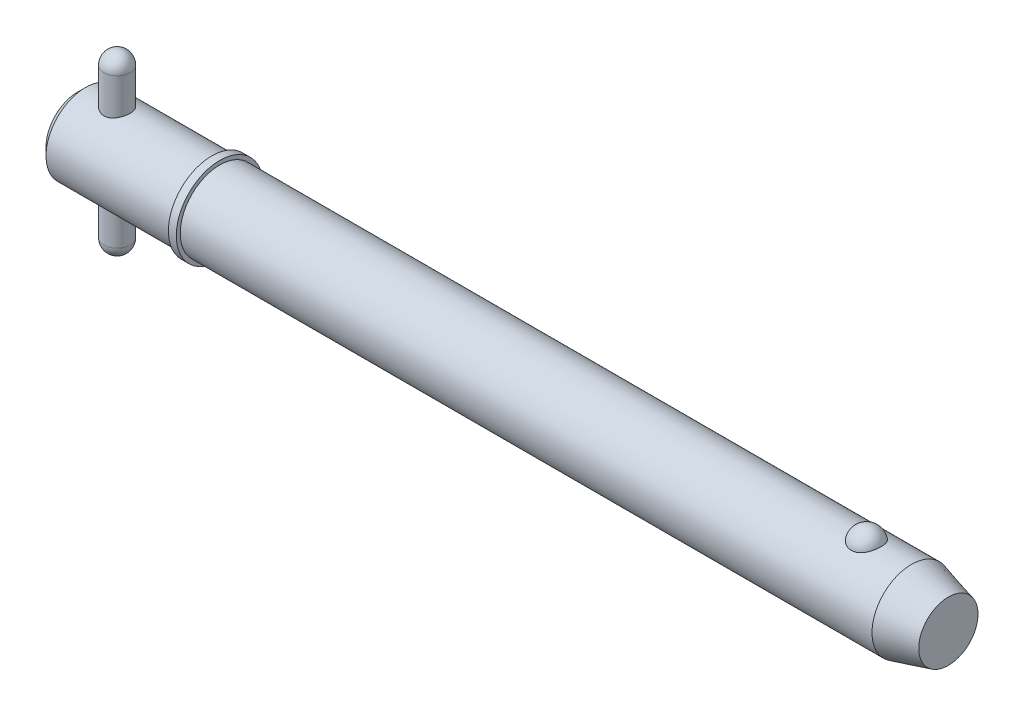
ISO-10303-21;
HEADER;
FILE_DESCRIPTION(('STEP AP214'),'2;1');
FILE_NAME('part.step','',(''),(''),'','','');
FILE_SCHEMA(('AUTOMOTIVE_DESIGN { 1 0 10303 214 1 1 1 1 }'));
ENDSEC;
DATA;
#1=APPLICATION_CONTEXT('core data for automotive mechanical design processes');
#2=APPLICATION_PROTOCOL_DEFINITION('international standard','automotive_design',2000,#1);
#3=PRODUCT_CONTEXT('',#1,'mechanical');
#4=PRODUCT('Part','Part','',(#3));
#5=PRODUCT_RELATED_PRODUCT_CATEGORY('part','',(#4));
#6=PRODUCT_DEFINITION_FORMATION('','',#4);
#7=PRODUCT_DEFINITION_CONTEXT('part definition',#1,'design');
#8=PRODUCT_DEFINITION('design','',#6,#7);
#9=PRODUCT_DEFINITION_SHAPE('','',#8);
#10=(LENGTH_UNIT() NAMED_UNIT(*) SI_UNIT(.MILLI.,.METRE.));
#11=(NAMED_UNIT(*) PLANE_ANGLE_UNIT() SI_UNIT($,.RADIAN.));
#12=(NAMED_UNIT(*) SI_UNIT($,.STERADIAN.) SOLID_ANGLE_UNIT());
#13=UNCERTAINTY_MEASURE_WITH_UNIT(LENGTH_MEASURE(1.E-05),#10,'distance_accuracy_value','');
#14=(GEOMETRIC_REPRESENTATION_CONTEXT(3) GLOBAL_UNCERTAINTY_ASSIGNED_CONTEXT((#13)) GLOBAL_UNIT_ASSIGNED_CONTEXT((#10,
#11,#12)) REPRESENTATION_CONTEXT('',''));
#15=CARTESIAN_POINT('',(0.,0.,0.));
#16=DIRECTION('',(0.,0.,1.));
#17=DIRECTION('',(1.,0.,0.));
#18=AXIS2_PLACEMENT_3D('',#15,#16,#17);
#19=CARTESIAN_POINT('',(7.14,15.875,0.));
#20=DIRECTION('',(0.,-1.,0.));
#21=DIRECTION('',(0.,0.,-1.));
#22=AXIS2_PLACEMENT_3D('',#19,#20,#21);
#23=CYLINDRICAL_SURFACE('',#22,2.38);
#24=CARTESIAN_POINT('',(7.14,-13.495,0.));
#25=DIRECTION('',(0.,-1.,0.));
#26=DIRECTION('',(0.,0.,-1.));
#27=AXIS2_PLACEMENT_3D('',#24,#25,#26);
#28=CIRCLE('',#27,2.38);
#29=CARTESIAN_POINT('',(7.14,-13.495,-2.38));
#30=VERTEX_POINT('',#29);
#31=EDGE_CURVE('P0_E10',#30,#30,#28,.F.);
#32=ORIENTED_EDGE('',*,*,#31,.T.);
#33=EDGE_LOOP('',(#32));
#34=FACE_BOUND('',#33,.T.);
#35=CARTESIAN_POINT('',(7.14,13.495,0.));
#36=DIRECTION('',(0.,-1.,0.));
#37=DIRECTION('',(0.,0.,-1.));
#38=AXIS2_PLACEMENT_3D('',#35,#36,#37);
#39=CIRCLE('',#38,2.38);
#40=CARTESIAN_POINT('',(7.14,13.495,-2.38));
#41=VERTEX_POINT('',#40);
#42=EDGE_CURVE('P0_E21',#41,#41,#39,.T.);
#43=ORIENTED_EDGE('',*,*,#42,.T.);
#44=EDGE_LOOP('',(#43));
#45=FACE_BOUND('',#44,.T.);
#46=ADVANCED_FACE('P0_F14',(#34,#45),#23,.T.);
#47=CARTESIAN_POINT('',(7.14,-13.495,0.));
#48=DIRECTION('',(0.,0.,1.));
#49=DIRECTION('',(1.,0.,0.));
#50=AXIS2_PLACEMENT_3D('',#47,#48,#49);
#51=SPHERICAL_SURFACE('',#50,2.38);
#52=CARTESIAN_POINT('',(7.14,-13.495,0.));
#53=DIRECTION('',(0.,-1.,0.));
#54=DIRECTION('',(0.,0.,-1.));
#55=AXIS2_PLACEMENT_3D('',#52,#53,#54);
#56=SPHERICAL_SURFACE('',#55,2.38);
#57=ORIENTED_EDGE('',*,*,#31,.F.);
#58=EDGE_LOOP('',(#57));
#59=FACE_BOUND('',#58,.T.);
#60=ADVANCED_FACE('P0_F29',(#59),#56,.T.);
#61=CARTESIAN_POINT('',(7.14,13.495,0.));
#62=DIRECTION('',(0.,0.,1.));
#63=DIRECTION('',(1.,0.,0.));
#64=AXIS2_PLACEMENT_3D('',#61,#62,#63);
#65=SPHERICAL_SURFACE('',#64,2.38);
#66=CARTESIAN_POINT('',(7.14,13.495,0.));
#67=DIRECTION('',(0.,-1.,0.));
#68=DIRECTION('',(0.,0.,-1.));
#69=AXIS2_PLACEMENT_3D('',#66,#67,#68);
#70=SPHERICAL_SURFACE('',#69,2.38);
#71=ORIENTED_EDGE('',*,*,#42,.F.);
#72=EDGE_LOOP('',(#71));
#73=FACE_BOUND('',#72,.T.);
#74=ADVANCED_FACE('P0_F16',(#73),#70,.T.);
#75=CLOSED_SHELL('',(#46,#60,#74));
#76=MANIFOLD_SOLID_BREP('P0_B1',#75);
#77=CARTESIAN_POINT('',(0.,0.,0.));
#78=DIRECTION('',(1.,0.,0.));
#79=DIRECTION('',(0.,0.,-1.));
#80=AXIS2_PLACEMENT_3D('',#77,#78,#79);
#81=CYLINDRICAL_SURFACE('',#80,7.145);
#82=CARTESIAN_POINT('',(150.78362424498,0.,0.));
#83=DIRECTION('',(1.,0.,0.));
#84=DIRECTION('',(0.,0.,-1.));
#85=AXIS2_PLACEMENT_3D('',#82,#83,#84);
#86=CIRCLE('',#85,7.145);
#87=CARTESIAN_POINT('',(150.78362424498,0.,-7.145));
#88=VERTEX_POINT('',#87);
#89=EDGE_CURVE('P1_E81',#88,#88,#86,.T.);
#90=ORIENTED_EDGE('',*,*,#89,.F.);
#91=EDGE_LOOP('',(#90));
#92=FACE_BOUND('',#91,.T.);
#93=CARTESIAN_POINT('',(25.7,0.,0.));
#94=DIRECTION('',(1.,0.,0.));
#95=DIRECTION('',(0.,0.,-1.));
#96=AXIS2_PLACEMENT_3D('',#93,#94,#95);
#97=CIRCLE('',#96,7.145);
#98=CARTESIAN_POINT('',(25.7,0.,-7.145));
#99=VERTEX_POINT('',#98);
#100=EDGE_CURVE('P1_E85',#99,#99,#97,.T.);
#101=ORIENTED_EDGE('',*,*,#100,.T.);
#102=EDGE_LOOP('',(#101));
#103=FACE_BOUND('',#102,.T.);
#104=CARTESIAN_POINT('',(142.639503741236,6.60328629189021,2.72903557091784));
#105=CARTESIAN_POINT('',(142.498315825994,6.60329644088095,2.7290249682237));
#106=CARTESIAN_POINT('',(142.356883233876,6.60799490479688,2.71772840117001));
#107=CARTESIAN_POINT('',(142.077955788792,6.62628236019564,2.6728193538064));
#108=CARTESIAN_POINT('',(141.940472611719,6.63989534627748,2.63914664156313));
#109=CARTESIAN_POINT('',(141.673889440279,6.67440775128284,2.55059642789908));
#110=CARTESIAN_POINT('',(141.544768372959,6.69528793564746,2.49577486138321));
#111=CARTESIAN_POINT('',(141.297869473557,6.74205585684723,2.36651799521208));
#112=CARTESIAN_POINT('',(141.180086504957,6.76794130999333,2.2920916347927));
#113=CARTESIAN_POINT('',(140.95516710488,6.82286177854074,2.12312937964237));
#114=CARTESIAN_POINT('',(140.848440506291,6.85196655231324,2.0280710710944));
#115=CARTESIAN_POINT('',(140.651918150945,6.90970232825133,1.82167822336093));
#116=CARTESIAN_POINT('',(140.562127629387,6.93833318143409,1.71033867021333));
#117=CARTESIAN_POINT('',(140.397667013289,6.9935167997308,1.46891951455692));
#118=CARTESIAN_POINT('',(140.323844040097,7.01992110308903,1.33822781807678));
#119=CARTESIAN_POINT('',(140.198088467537,7.06643385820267,1.06566567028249));
#120=CARTESIAN_POINT('',(140.14615735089,7.08654188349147,0.923794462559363));
#121=CARTESIAN_POINT('',(140.064732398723,7.11862399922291,0.630993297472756));
#122=CARTESIAN_POINT('',(140.035516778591,7.13049704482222,0.479974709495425));
#123=CARTESIAN_POINT('',(140.001174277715,7.14449484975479,0.174782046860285));
#124=CARTESIAN_POINT('',(139.996046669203,7.14661990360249,0.020608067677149));
#125=CARTESIAN_POINT('',(140.009938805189,7.14092465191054,-0.285506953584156));
#126=CARTESIAN_POINT('',(140.028810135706,7.1331654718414,-0.437455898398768));
#127=CARTESIAN_POINT('',(140.090062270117,7.10859076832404,-0.73577860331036));
#128=CARTESIAN_POINT('',(140.132443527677,7.0917750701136,-0.882152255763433));
#129=CARTESIAN_POINT('',(140.239934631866,7.05076716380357,-1.16543149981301));
#130=CARTESIAN_POINT('',(140.305075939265,7.02656475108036,-1.30232366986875));
#131=CARTESIAN_POINT('',(140.456759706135,6.97329145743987,-1.56265907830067));
#132=CARTESIAN_POINT('',(140.543303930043,6.94422017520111,-1.68610120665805));
#133=CARTESIAN_POINT('',(140.736465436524,6.88415108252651,-1.91671004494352));
#134=CARTESIAN_POINT('',(140.843180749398,6.85314438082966,-2.02379244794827));
#135=CARTESIAN_POINT('',(141.073974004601,6.79282069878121,-2.21787433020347));
#136=CARTESIAN_POINT('',(141.198050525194,6.76350358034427,-2.30487545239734));
#137=CARTESIAN_POINT('',(141.457678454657,6.71060580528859,-2.45458647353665));
#138=CARTESIAN_POINT('',(141.592938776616,6.68691885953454,-2.51776240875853));
#139=CARTESIAN_POINT('',(141.873277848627,6.64741247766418,-2.62030218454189));
#140=CARTESIAN_POINT('',(142.018352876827,6.63159007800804,-2.65967499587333));
#141=CARTESIAN_POINT('',(142.306347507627,6.61038594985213,-2.71193301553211));
#142=CARTESIAN_POINT('',(142.44900807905,6.60451880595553,-2.72605165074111));
#143=CARTESIAN_POINT('',(142.73480047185,6.60240611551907,-2.73116688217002));
#144=CARTESIAN_POINT('',(142.877932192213,6.60615862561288,-2.7221681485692));
#145=CARTESIAN_POINT('',(143.155848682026,6.62256094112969,-2.68200435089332));
#146=CARTESIAN_POINT('',(143.290754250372,6.63492533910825,-2.65154998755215));
#147=CARTESIAN_POINT('',(143.55332009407,6.66687445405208,-2.57015684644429));
#148=CARTESIAN_POINT('',(143.68097978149,6.68645975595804,-2.51921640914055));
#149=CARTESIAN_POINT('',(143.928577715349,6.73127274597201,-2.39693610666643));
#150=CARTESIAN_POINT('',(144.048287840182,6.7566138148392,-2.32517694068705));
#151=CARTESIAN_POINT('',(144.274159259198,6.81006003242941,-2.16363812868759));
#152=CARTESIAN_POINT('',(144.380317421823,6.83816581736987,-2.07385432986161));
#153=CARTESIAN_POINT('',(144.581862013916,6.89580469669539,-1.87357235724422));
#154=CARTESIAN_POINT('',(144.676440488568,6.92533863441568,-1.76226074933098));
#155=CARTESIAN_POINT('',(144.846332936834,6.98139526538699,-1.5251169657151));
#156=CARTESIAN_POINT('',(144.921643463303,7.0079174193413,-1.39928219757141));
#157=CARTESIAN_POINT('',(145.053595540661,7.05607625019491,-1.1321597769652));
#158=CARTESIAN_POINT('',(145.109568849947,7.07753119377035,-0.990508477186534));
#159=CARTESIAN_POINT('',(145.198296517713,7.11222355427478,-0.699154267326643));
#160=CARTESIAN_POINT('',(145.231050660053,7.12546089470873,-0.549451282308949));
#161=CARTESIAN_POINT('',(145.272689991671,7.14237584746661,-0.246120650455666));
#162=CARTESIAN_POINT('',(145.281558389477,7.14604673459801,-0.0924903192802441));
#163=CARTESIAN_POINT('',(145.275194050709,7.14343510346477,0.214181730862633));
#164=CARTESIAN_POINT('',(145.259961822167,7.13715279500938,0.367223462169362));
#165=CARTESIAN_POINT('',(145.205845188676,7.1153294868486,0.667595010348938));
#166=CARTESIAN_POINT('',(145.167077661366,7.09983424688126,0.814949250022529));
#167=CARTESIAN_POINT('',(145.066770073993,7.06119140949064,1.1006322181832));
#168=CARTESIAN_POINT('',(145.005228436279,7.03804328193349,1.23896032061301));
#169=CARTESIAN_POINT('',(144.860207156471,6.98632429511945,1.50352300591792));
#170=CARTESIAN_POINT('',(144.776606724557,6.95772382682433,1.62968561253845));
#171=CARTESIAN_POINT('',(144.58938046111,6.89823072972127,1.86554304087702));
#172=CARTESIAN_POINT('',(144.485755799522,6.86733823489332,1.97523882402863));
#173=CARTESIAN_POINT('',(144.261076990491,6.80676456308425,2.174822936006));
#174=CARTESIAN_POINT('',(144.140067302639,6.7770805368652,2.26476035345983));
#175=CARTESIAN_POINT('',(143.883340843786,6.7223050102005,2.42252989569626));
#176=CARTESIAN_POINT('',(143.74761851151,6.69721525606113,2.4903536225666));
#177=CARTESIAN_POINT('',(143.470402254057,6.65552591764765,2.59967646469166));
#178=CARTESIAN_POINT('',(143.329281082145,6.63865794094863,2.6420201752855));
#179=CARTESIAN_POINT('',(143.041444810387,6.61425039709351,2.70255841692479));
#180=CARTESIAN_POINT('',(142.894748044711,6.606682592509,2.72082606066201));
#181=CARTESIAN_POINT('',(142.711679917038,6.60358754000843,2.72830331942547));
#182=CARTESIAN_POINT('',(142.675599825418,6.60328369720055,2.72903828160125));
#183=CARTESIAN_POINT('',(142.639503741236,6.60328629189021,2.72903557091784));
#184=B_SPLINE_CURVE_WITH_KNOTS('',3,(#104,#105,#106,#107,#108,#109,#110,#111,#112,#113,#114,
#115,#116,#117,#118,#119,#120,#121,#122,#123,#124,#125,#126,#127,#128,#129,#130,#131,#132,#133,
#134,#135,#136,#137,#138,#139,#140,#141,#142,#143,#144,#145,#146,#147,#148,#149,#150,#151,#152,
#153,#154,#155,#156,#157,#158,#159,#160,#161,#162,#163,#164,#165,#166,#167,#168,#169,#170,#171,
#172,#173,#174,#175,#176,#177,#178,#179,#180,#181,#182,#183),.UNSPECIFIED.,.T.,.F.,(4,2,2,2,2,2,
2,2,2,2,2,2,2,2,2,2,2,2,2,2,2,2,2,2,2,2,2,2,2,2,2,2,2,2,2,2,2,2,2,4),(0.,0.423468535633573,
0.848081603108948,1.27157926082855,1.69488414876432,2.13051395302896,2.56627819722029,
3.02136706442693,3.47648674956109,3.93709649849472,4.39769233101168,4.85545355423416,
5.31322361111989,5.77162895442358,6.23007210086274,6.69080337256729,7.15149693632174,
7.60264329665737,8.05361952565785,8.48189729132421,8.91008854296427,9.32472524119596,
9.73939553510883,10.1630783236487,10.5868588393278,11.0319070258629,11.4770347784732,
11.9362874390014,12.3955443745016,12.8551240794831,13.3146940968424,13.7720003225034,
14.2293382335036,14.6892343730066,15.1491036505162,15.6078171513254,16.0667046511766,
16.5093965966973,16.9507410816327,17.0590049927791),.UNSPECIFIED.);
#185=CARTESIAN_POINT('',(142.639503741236,6.60328629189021,2.72903557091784));
#186=VERTEX_POINT('',#185);
#187=EDGE_CURVE('P1_E35',#186,#186,#184,.T.);
#188=ORIENTED_EDGE('',*,*,#187,.T.);
#189=EDGE_LOOP('',(#188));
#190=FACE_BOUND('',#189,.T.);
#191=ADVANCED_FACE('P1_F13',(#92,#103,#190),#81,.T.);
#192=CARTESIAN_POINT('',(0.,0.,0.));
#193=DIRECTION('',(-1.,0.,0.));
#194=DIRECTION('',(0.,0.,1.));
#195=AXIS2_PLACEMENT_3D('',#192,#193,#194);
#196=PLANE('',#195);
#197=CARTESIAN_POINT('',(0.,0.,0.));
#198=DIRECTION('',(1.,0.,0.));
#199=DIRECTION('',(0.,0.,-1.));
#200=AXIS2_PLACEMENT_3D('',#197,#198,#199);
#201=CIRCLE('',#200,5.716);
#202=CARTESIAN_POINT('',(0.,0.,-5.716));
#203=VERTEX_POINT('',#202);
#204=EDGE_CURVE('P1_E9',#203,#203,#201,.T.);
#205=ORIENTED_EDGE('',*,*,#204,.F.);
#206=EDGE_LOOP('',(#205));
#207=FACE_BOUND('',#206,.T.);
#208=ADVANCED_FACE('P1_F15',(#207),#196,.T.);
#209=CARTESIAN_POINT('',(1.42899999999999,0.,0.));
#210=DIRECTION('',(1.,0.,0.));
#211=DIRECTION('',(0.,0.,-1.));
#212=AXIS2_PLACEMENT_3D('',#209,#210,#211);
#213=CONICAL_SURFACE('',#212,7.145,0.78539816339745);
#214=ORIENTED_EDGE('',*,*,#204,.T.);
#215=EDGE_LOOP('',(#214));
#216=FACE_BOUND('',#215,.T.);
#217=CARTESIAN_POINT('',(1.42899999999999,0.,0.));
#218=DIRECTION('',(1.,0.,0.));
#219=DIRECTION('',(0.,0.,-1.));
#220=AXIS2_PLACEMENT_3D('',#217,#218,#219);
#221=CIRCLE('',#220,7.145);
#222=CARTESIAN_POINT('',(1.42899999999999,0.,-7.145));
#223=VERTEX_POINT('',#222);
#224=EDGE_CURVE('P1_E26',#223,#223,#221,.T.);
#225=ORIENTED_EDGE('',*,*,#224,.F.);
#226=EDGE_LOOP('',(#225));
#227=FACE_BOUND('',#226,.T.);
#228=ADVANCED_FACE('P1_F77',(#216,#227),#213,.T.);
#229=CARTESIAN_POINT('',(0.,0.,0.));
#230=DIRECTION('',(1.,0.,0.));
#231=DIRECTION('',(0.,0.,-1.));
#232=AXIS2_PLACEMENT_3D('',#229,#230,#231);
#233=CYLINDRICAL_SURFACE('',#232,7.145);
#234=CARTESIAN_POINT('',(7.14,-6.73695962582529,2.38));
#235=CARTESIAN_POINT('',(7.01035997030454,-6.73695921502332,2.38000059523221));
#236=CARTESIAN_POINT('',(6.88072348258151,-6.74074253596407,2.36937183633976));
#237=CARTESIAN_POINT('',(6.62529075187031,-6.75538853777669,2.32728080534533));
#238=CARTESIAN_POINT('',(6.49949514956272,-6.76625239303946,2.29581507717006));
#239=CARTESIAN_POINT('',(6.2554858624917,-6.79369535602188,2.21327763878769));
#240=CARTESIAN_POINT('',(6.13725786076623,-6.81026326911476,2.16224430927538));
#241=CARTESIAN_POINT('',(5.91100349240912,-6.84723128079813,2.04215132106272));
#242=CARTESIAN_POINT('',(5.80297937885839,-6.86763222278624,1.97308769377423));
#243=CARTESIAN_POINT('',(5.59597854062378,-6.91086152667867,1.81600414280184));
#244=CARTESIAN_POINT('',(5.49745861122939,-6.93375032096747,1.72739874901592));
#245=CARTESIAN_POINT('',(5.31636508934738,-6.97886546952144,1.53499636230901));
#246=CARTESIAN_POINT('',(5.23379405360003,-7.00109171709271,1.43119693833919));
#247=CARTESIAN_POINT('',(5.08487013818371,-7.04307708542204,1.20801318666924));
#248=CARTESIAN_POINT('',(5.01899578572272,-7.06275685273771,1.08829330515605));
#249=CARTESIAN_POINT('',(4.90850130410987,-7.09671988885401,0.838703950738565));
#250=CARTESIAN_POINT('',(4.86387545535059,-7.11100460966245,0.70883722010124));
#251=CARTESIAN_POINT('',(4.79869354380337,-7.13213998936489,0.44742990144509));
#252=CARTESIAN_POINT('',(4.77735497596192,-7.13923172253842,0.316104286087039));
#253=CARTESIAN_POINT('',(4.75686536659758,-7.14603777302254,0.0515578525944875));
#254=CARTESIAN_POINT('',(4.75770861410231,-7.14575398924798,-0.0816624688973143));
#255=CARTESIAN_POINT('',(4.78106216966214,-7.13800438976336,-0.340678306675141));
#256=CARTESIAN_POINT('',(4.80272255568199,-7.13082030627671,-0.466560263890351));
#257=CARTESIAN_POINT('',(4.86569013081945,-7.11043095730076,-0.712788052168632));
#258=CARTESIAN_POINT('',(4.90699865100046,-7.09722528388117,-0.833133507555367));
#259=CARTESIAN_POINT('',(5.00858673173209,-7.06591754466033,-1.06673173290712));
#260=CARTESIAN_POINT('',(5.06910834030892,-7.0477534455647,-1.17987058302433));
#261=CARTESIAN_POINT('',(5.20720514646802,-7.00841977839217,-1.39463797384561));
#262=CARTESIAN_POINT('',(5.28478508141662,-6.987249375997,-1.49626330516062));
#263=CARTESIAN_POINT('',(5.4590800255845,-6.94296010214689,-1.69017445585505));
#264=CARTESIAN_POINT('',(5.55652324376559,-6.91979641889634,-1.78179645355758));
#265=CARTESIAN_POINT('',(5.76558873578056,-6.87497076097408,-1.94761348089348));
#266=CARTESIAN_POINT('',(5.87721318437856,-6.85330901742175,-2.02180583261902));
#267=CARTESIAN_POINT('',(6.11357367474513,-6.81369485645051,-2.15157488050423));
#268=CARTESIAN_POINT('',(6.23847358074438,-6.79579956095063,-2.20687188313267));
#269=CARTESIAN_POINT('',(6.49655785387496,-6.76640630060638,-2.29542443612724));
#270=CARTESIAN_POINT('',(6.62973872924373,-6.75490565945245,-2.32868920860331));
#271=CARTESIAN_POINT('',(6.89417536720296,-6.74020933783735,-2.37088225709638));
#272=CARTESIAN_POINT('',(7.02524746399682,-6.73666278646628,-2.38083959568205));
#273=CARTESIAN_POINT('',(7.28721035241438,-6.73729555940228,-2.37904974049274));
#274=CARTESIAN_POINT('',(7.41810117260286,-6.7414734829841,-2.36730648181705));
#275=CARTESIAN_POINT('',(7.67130717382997,-6.75673471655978,-2.32337336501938));
#276=CARTESIAN_POINT('',(7.79376251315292,-6.76757635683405,-2.29189834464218));
#277=CARTESIAN_POINT('',(8.03162917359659,-6.79467771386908,-2.21025275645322));
#278=CARTESIAN_POINT('',(8.14703924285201,-6.8109383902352,-2.16007887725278));
#279=CARTESIAN_POINT('',(8.37159169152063,-6.84768362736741,-2.04065289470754));
#280=CARTESIAN_POINT('',(8.48041962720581,-6.86828569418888,-1.97084668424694));
#281=CARTESIAN_POINT('',(8.68518919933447,-6.91116416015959,-1.8147657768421));
#282=CARTESIAN_POINT('',(8.78112702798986,-6.93344105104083,-1.72848623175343));
#283=CARTESIAN_POINT('',(8.96215574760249,-6.97845348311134,-1.53698616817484));
#284=CARTESIAN_POINT('',(9.04650427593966,-7.00115965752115,-1.43105491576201));
#285=CARTESIAN_POINT('',(9.19627592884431,-7.04341676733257,-1.20598377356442));
#286=CARTESIAN_POINT('',(9.26169972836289,-7.06296781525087,-1.08684435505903));
#287=CARTESIAN_POINT('',(9.37116617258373,-7.0966205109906,-0.83933303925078));
#288=CARTESIAN_POINT('',(9.41534821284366,-7.11075755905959,-0.711027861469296));
#289=CARTESIAN_POINT('',(9.48132660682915,-7.13214194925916,-0.448245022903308));
#290=CARTESIAN_POINT('',(9.50313102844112,-7.13939177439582,-0.313769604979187));
#291=CARTESIAN_POINT('',(9.5230098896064,-7.14599771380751,-0.049254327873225));
#292=CARTESIAN_POINT('',(9.52215013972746,-7.14570837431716,0.0806974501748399));
#293=CARTESIAN_POINT('',(9.49935359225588,-7.13814116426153,0.338518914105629));
#294=CARTESIAN_POINT('',(9.47741850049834,-7.13086385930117,0.466388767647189));
#295=CARTESIAN_POINT('',(9.4138005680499,-7.11026814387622,0.714400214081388));
#296=CARTESIAN_POINT('',(9.37243609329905,-7.09704726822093,0.834632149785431));
#297=CARTESIAN_POINT('',(9.27142829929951,-7.06592602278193,1.06649582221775));
#298=CARTESIAN_POINT('',(9.2117816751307,-7.04802480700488,1.1781259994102));
#299=CARTESIAN_POINT('',(9.07336776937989,-7.00856499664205,1.39411030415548));
#300=CARTESIAN_POINT('',(8.99397590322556,-6.98689577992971,1.49804368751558));
#301=CARTESIAN_POINT('',(8.81938810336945,-6.9426110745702,1.69146078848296));
#302=CARTESIAN_POINT('',(8.72418713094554,-6.91999528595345,1.78093988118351));
#303=CARTESIAN_POINT('',(8.51623540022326,-6.87531507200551,1.94646188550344));
#304=CARTESIAN_POINT('',(8.4029442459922,-6.85330672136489,2.02184316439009));
#305=CARTESIAN_POINT('',(8.16461714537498,-6.81342065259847,2.1524427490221));
#306=CARTESIAN_POINT('',(8.03958429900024,-6.7955418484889,2.20766635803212));
#307=CARTESIAN_POINT('',(7.78712566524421,-6.76686117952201,2.29403636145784));
#308=CARTESIAN_POINT('',(7.66006989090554,-6.75577342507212,2.32616709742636));
#309=CARTESIAN_POINT('',(7.40200728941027,-6.74082409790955,2.36914495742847));
#310=CARTESIAN_POINT('',(7.27100183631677,-6.73696004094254,2.37999939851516));
#311=CARTESIAN_POINT('',(7.14,-6.73695962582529,2.38));
#312=B_SPLINE_CURVE_WITH_KNOTS('',3,(#234,#235,#236,#237,#238,#239,#240,#241,#242,#243,#244,
#245,#246,#247,#248,#249,#250,#251,#252,#253,#254,#255,#256,#257,#258,#259,#260,#261,#262,#263,
#264,#265,#266,#267,#268,#269,#270,#271,#272,#273,#274,#275,#276,#277,#278,#279,#280,#281,#282,
#283,#284,#285,#286,#287,#288,#289,#290,#291,#292,#293,#294,#295,#296,#297,#298,#299,#300,#301,
#302,#303,#304,#305,#306,#307,#308,#309,#310,#311),.UNSPECIFIED.,.T.,.F.,(4,2,2,2,2,2,2,2,2,2,2,
2,2,2,2,2,2,2,2,2,2,2,2,2,2,2,2,2,2,2,2,2,2,2,2,2,2,2,4),(0.,0.388434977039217,
0.776934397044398,1.16467566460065,1.55250234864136,1.9540847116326,2.35573139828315,
2.76784120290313,3.17984001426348,3.57752248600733,3.97510257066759,4.35711073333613,
4.7391447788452,5.12619663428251,5.51335611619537,5.91871976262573,6.3241456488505,
6.73533623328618,7.14635459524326,7.53885245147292,7.93127914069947,8.31025106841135,
8.68929014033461,9.08033871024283,9.47150254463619,9.88145528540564,10.2913934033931,
10.6986033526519,11.1056664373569,11.4936225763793,11.8815473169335,12.2633262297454,
12.645174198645,13.0411187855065,13.437189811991,13.8487371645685,14.2601761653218,
14.6528265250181,15.0453418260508),.UNSPECIFIED.);
#313=CARTESIAN_POINT('',(7.14,-6.73695962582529,2.38));
#314=VERTEX_POINT('',#313);
#315=EDGE_CURVE('P1_E17',#314,#314,#312,.T.);
#316=ORIENTED_EDGE('',*,*,#315,.F.);
#317=EDGE_LOOP('',(#316));
#318=FACE_BOUND('',#317,.T.);
#319=CARTESIAN_POINT('',(7.14,6.73695962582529,2.38));
#320=CARTESIAN_POINT('',(7.26964002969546,6.73695921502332,2.38000059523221));
#321=CARTESIAN_POINT('',(7.39927651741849,6.74074253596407,2.36937183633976));
#322=CARTESIAN_POINT('',(7.65470924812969,6.75538853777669,2.32728080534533));
#323=CARTESIAN_POINT('',(7.78050485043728,6.76625239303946,2.29581507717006));
#324=CARTESIAN_POINT('',(8.02451413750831,6.79369535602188,2.21327763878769));
#325=CARTESIAN_POINT('',(8.14274213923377,6.81026326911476,2.16224430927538));
#326=CARTESIAN_POINT('',(8.36899650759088,6.84723128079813,2.04215132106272));
#327=CARTESIAN_POINT('',(8.47702062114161,6.86763222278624,1.97308769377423));
#328=CARTESIAN_POINT('',(8.68402145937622,6.91086152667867,1.81600414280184));
#329=CARTESIAN_POINT('',(8.78254138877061,6.93375032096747,1.72739874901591));
#330=CARTESIAN_POINT('',(8.96363491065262,6.97886546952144,1.53499636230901));
#331=CARTESIAN_POINT('',(9.04620594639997,7.00109171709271,1.43119693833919));
#332=CARTESIAN_POINT('',(9.19512986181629,7.04307708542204,1.20801318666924));
#333=CARTESIAN_POINT('',(9.26100421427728,7.06275685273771,1.08829330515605));
#334=CARTESIAN_POINT('',(9.37149869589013,7.09671988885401,0.838703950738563));
#335=CARTESIAN_POINT('',(9.41612454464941,7.11100460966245,0.708837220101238));
#336=CARTESIAN_POINT('',(9.48130645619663,7.13213998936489,0.447429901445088));
#337=CARTESIAN_POINT('',(9.50264502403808,7.13923172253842,0.316104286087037));
#338=CARTESIAN_POINT('',(9.52313463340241,7.14603777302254,0.0515578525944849));
#339=CARTESIAN_POINT('',(9.52229138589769,7.14575398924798,-0.0816624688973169));
#340=CARTESIAN_POINT('',(9.49893783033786,7.13800438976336,-0.340678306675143));
#341=CARTESIAN_POINT('',(9.47727744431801,7.13082030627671,-0.466560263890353));
#342=CARTESIAN_POINT('',(9.41430986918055,7.11043095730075,-0.712788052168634));
#343=CARTESIAN_POINT('',(9.37300134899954,7.09722528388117,-0.833133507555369));
#344=CARTESIAN_POINT('',(9.27141326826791,7.06591754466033,-1.06673173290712));
#345=CARTESIAN_POINT('',(9.21089165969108,7.0477534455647,-1.17987058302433));
#346=CARTESIAN_POINT('',(9.07279485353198,7.00841977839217,-1.39463797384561));
#347=CARTESIAN_POINT('',(8.99521491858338,6.987249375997,-1.49626330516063));
#348=CARTESIAN_POINT('',(8.82091997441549,6.94296010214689,-1.69017445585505));
#349=CARTESIAN_POINT('',(8.72347675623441,6.91979641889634,-1.78179645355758));
#350=CARTESIAN_POINT('',(8.51441126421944,6.87497076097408,-1.94761348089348));
#351=CARTESIAN_POINT('',(8.40278681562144,6.85330901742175,-2.02180583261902));
#352=CARTESIAN_POINT('',(8.16642632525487,6.81369485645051,-2.15157488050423));
#353=CARTESIAN_POINT('',(8.04152641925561,6.79579956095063,-2.20687188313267));
#354=CARTESIAN_POINT('',(7.78344214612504,6.76640630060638,-2.29542443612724));
#355=CARTESIAN_POINT('',(7.65026127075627,6.75490565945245,-2.32868920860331));
#356=CARTESIAN_POINT('',(7.38582463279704,6.74020933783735,-2.37088225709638));
#357=CARTESIAN_POINT('',(7.25475253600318,6.73666278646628,-2.38083959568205));
#358=CARTESIAN_POINT('',(6.99278964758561,6.73729555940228,-2.37904974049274));
#359=CARTESIAN_POINT('',(6.86189882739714,6.7414734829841,-2.36730648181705));
#360=CARTESIAN_POINT('',(6.60869282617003,6.75673471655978,-2.32337336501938));
#361=CARTESIAN_POINT('',(6.48623748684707,6.76757635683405,-2.29189834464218));
#362=CARTESIAN_POINT('',(6.2483708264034,6.79467771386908,-2.21025275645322));
#363=CARTESIAN_POINT('',(6.13296075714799,6.8109383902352,-2.16007887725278));
#364=CARTESIAN_POINT('',(5.90840830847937,6.84768362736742,-2.04065289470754));
#365=CARTESIAN_POINT('',(5.79958037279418,6.86828569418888,-1.97084668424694));
#366=CARTESIAN_POINT('',(5.59481080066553,6.91116416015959,-1.8147657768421));
#367=CARTESIAN_POINT('',(5.49887297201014,6.93344105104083,-1.72848623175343));
#368=CARTESIAN_POINT('',(5.31784425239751,6.97845348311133,-1.53698616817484));
#369=CARTESIAN_POINT('',(5.23349572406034,7.00115965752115,-1.43105491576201));
#370=CARTESIAN_POINT('',(5.08372407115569,7.04341676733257,-1.20598377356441));
#371=CARTESIAN_POINT('',(5.01830027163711,7.06296781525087,-1.08684435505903));
#372=CARTESIAN_POINT('',(4.90883382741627,7.0966205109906,-0.839333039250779));
#373=CARTESIAN_POINT('',(4.86465178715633,7.11075755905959,-0.711027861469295));
#374=CARTESIAN_POINT('',(4.79867339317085,7.13214194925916,-0.448245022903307));
#375=CARTESIAN_POINT('',(4.77686897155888,7.13939177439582,-0.313769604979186));
#376=CARTESIAN_POINT('',(4.7569901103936,7.14599771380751,-0.0492543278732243));
#377=CARTESIAN_POINT('',(4.75784986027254,7.14570837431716,0.0806974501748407));
#378=CARTESIAN_POINT('',(4.78064640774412,7.13814116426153,0.33851891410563));
#379=CARTESIAN_POINT('',(4.80258149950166,7.13086385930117,0.46638876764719));
#380=CARTESIAN_POINT('',(4.8661994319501,7.11026814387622,0.714400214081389));
#381=CARTESIAN_POINT('',(4.90756390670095,7.09704726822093,0.834632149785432));
#382=CARTESIAN_POINT('',(5.00857170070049,7.06592602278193,1.06649582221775));
#383=CARTESIAN_POINT('',(5.0682183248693,7.04802480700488,1.1781259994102));
#384=CARTESIAN_POINT('',(5.20663223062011,7.00856499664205,1.39411030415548));
#385=CARTESIAN_POINT('',(5.28602409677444,6.98689577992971,1.49804368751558));
#386=CARTESIAN_POINT('',(5.46061189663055,6.9426110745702,1.69146078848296));
#387=CARTESIAN_POINT('',(5.55581286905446,6.91999528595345,1.78093988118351));
#388=CARTESIAN_POINT('',(5.76376459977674,6.87531507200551,1.94646188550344));
#389=CARTESIAN_POINT('',(5.8770557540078,6.85330672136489,2.02184316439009));
#390=CARTESIAN_POINT('',(6.11538285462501,6.81342065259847,2.1524427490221));
#391=CARTESIAN_POINT('',(6.24041570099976,6.7955418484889,2.20766635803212));
#392=CARTESIAN_POINT('',(6.4928743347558,6.76686117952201,2.29403636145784));
#393=CARTESIAN_POINT('',(6.61993010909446,6.75577342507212,2.32616709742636));
#394=CARTESIAN_POINT('',(6.87799271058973,6.74082409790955,2.36914495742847));
#395=CARTESIAN_POINT('',(7.00899816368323,6.73696004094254,2.37999939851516));
#396=CARTESIAN_POINT('',(7.14,6.73695962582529,2.38));
#397=B_SPLINE_CURVE_WITH_KNOTS('',3,(#319,#320,#321,#322,#323,#324,#325,#326,#327,#328,#329,
#330,#331,#332,#333,#334,#335,#336,#337,#338,#339,#340,#341,#342,#343,#344,#345,#346,#347,#348,
#349,#350,#351,#352,#353,#354,#355,#356,#357,#358,#359,#360,#361,#362,#363,#364,#365,#366,#367,
#368,#369,#370,#371,#372,#373,#374,#375,#376,#377,#378,#379,#380,#381,#382,#383,#384,#385,#386,
#387,#388,#389,#390,#391,#392,#393,#394,#395,#396),.UNSPECIFIED.,.T.,.F.,(4,2,2,2,2,2,2,2,2,2,2,
2,2,2,2,2,2,2,2,2,2,2,2,2,2,2,2,2,2,2,2,2,2,2,2,2,2,2,4),(0.,0.388434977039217,
0.776934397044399,1.16467566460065,1.55250234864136,1.9540847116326,2.35573139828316,
2.76784120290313,3.17984001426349,3.57752248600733,3.97510257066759,4.35711073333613,
4.73914477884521,5.12619663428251,5.51335611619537,5.91871976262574,6.3241456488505,
6.73533623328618,7.14635459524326,7.53885245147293,7.93127914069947,8.31025106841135,
8.68929014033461,9.08033871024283,9.47150254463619,9.88145528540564,10.2913934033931,
10.6986033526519,11.1056664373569,11.4936225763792,11.8815473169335,12.2633262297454,
12.645174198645,13.0411187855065,13.437189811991,13.8487371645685,14.2601761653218,
14.6528265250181,15.0453418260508),.UNSPECIFIED.);
#398=CARTESIAN_POINT('',(7.14,6.73695962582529,2.38));
#399=VERTEX_POINT('',#398);
#400=EDGE_CURVE('P1_E43',#399,#399,#397,.T.);
#401=ORIENTED_EDGE('',*,*,#400,.F.);
#402=EDGE_LOOP('',(#401));
#403=FACE_BOUND('',#402,.T.);
#404=ORIENTED_EDGE('',*,*,#224,.T.);
#405=EDGE_LOOP('',(#404));
#406=FACE_BOUND('',#405,.T.);
#407=CARTESIAN_POINT('',(24.271,0.,0.));
#408=DIRECTION('',(1.,0.,0.));
#409=DIRECTION('',(0.,0.,-1.));
#410=AXIS2_PLACEMENT_3D('',#407,#408,#409);
#411=CIRCLE('',#410,7.145);
#412=CARTESIAN_POINT('',(24.271,0.,-7.145));
#413=VERTEX_POINT('',#412);
#414=EDGE_CURVE('P1_E31',#413,#413,#411,.T.);
#415=ORIENTED_EDGE('',*,*,#414,.F.);
#416=EDGE_LOOP('',(#415));
#417=FACE_BOUND('',#416,.T.);
#418=ADVANCED_FACE('P1_F103',(#318,#403,#406,#417),#233,.T.);
#419=CARTESIAN_POINT('',(24.271,7.145,0.));
#420=DIRECTION('',(-1.,0.,0.));
#421=DIRECTION('',(0.,0.,1.));
#422=AXIS2_PLACEMENT_3D('',#419,#420,#421);
#423=PLANE('',#422);
#424=ORIENTED_EDGE('',*,*,#414,.T.);
#425=EDGE_LOOP('',(#424));
#426=FACE_BOUND('',#425,.T.);
#427=CARTESIAN_POINT('',(24.271,0.,0.));
#428=DIRECTION('',(1.,0.,0.));
#429=DIRECTION('',(0.,0.,-1.));
#430=AXIS2_PLACEMENT_3D('',#427,#428,#429);
#431=CIRCLE('',#430,7.8595);
#432=CARTESIAN_POINT('',(24.271,0.,-7.8595));
#433=VERTEX_POINT('',#432);
#434=EDGE_CURVE('P1_E91',#433,#433,#431,.T.);
#435=ORIENTED_EDGE('',*,*,#434,.F.);
#436=EDGE_LOOP('',(#435));
#437=FACE_BOUND('',#436,.T.);
#438=ADVANCED_FACE('P1_F100',(#426,#437),#423,.T.);
#439=CARTESIAN_POINT('',(0.,0.,0.));
#440=DIRECTION('',(1.,0.,0.));
#441=DIRECTION('',(0.,0.,-1.));
#442=AXIS2_PLACEMENT_3D('',#439,#440,#441);
#443=CYLINDRICAL_SURFACE('',#442,7.8595);
#444=ORIENTED_EDGE('',*,*,#434,.T.);
#445=EDGE_LOOP('',(#444));
#446=FACE_BOUND('',#445,.T.);
#447=CARTESIAN_POINT('',(25.7,0.,0.));
#448=DIRECTION('',(1.,0.,0.));
#449=DIRECTION('',(0.,0.,-1.));
#450=AXIS2_PLACEMENT_3D('',#447,#448,#449);
#451=CIRCLE('',#450,7.8595);
#452=CARTESIAN_POINT('',(25.7,0.,-7.8595));
#453=VERTEX_POINT('',#452);
#454=EDGE_CURVE('P1_E88',#453,#453,#451,.T.);
#455=ORIENTED_EDGE('',*,*,#454,.F.);
#456=EDGE_LOOP('',(#455));
#457=FACE_BOUND('',#456,.T.);
#458=ADVANCED_FACE('P1_F68',(#446,#457),#443,.T.);
#459=CARTESIAN_POINT('',(25.7,7.8595,0.));
#460=DIRECTION('',(1.,0.,0.));
#461=DIRECTION('',(0.,0.,-1.));
#462=AXIS2_PLACEMENT_3D('',#459,#460,#461);
#463=PLANE('',#462);
#464=ORIENTED_EDGE('',*,*,#454,.T.);
#465=EDGE_LOOP('',(#464));
#466=FACE_BOUND('',#465,.T.);
#467=ORIENTED_EDGE('',*,*,#100,.F.);
#468=EDGE_LOOP('',(#467));
#469=FACE_BOUND('',#468,.T.);
#470=ADVANCED_FACE('P1_F62',(#466,#469),#463,.T.);
#471=CARTESIAN_POINT('',(157.45,0.,0.));
#472=DIRECTION('',(-1.,0.,0.));
#473=DIRECTION('',(0.,0.,1.));
#474=AXIS2_PLACEMENT_3D('',#471,#472,#473);
#475=CONICAL_SURFACE('',#474,5.35875000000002,0.26179938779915);
#476=ORIENTED_EDGE('',*,*,#89,.T.);
#477=EDGE_LOOP('',(#476));
#478=FACE_BOUND('',#477,.T.);
#479=CARTESIAN_POINT('',(157.45,0.,0.));
#480=DIRECTION('',(1.,0.,0.));
#481=DIRECTION('',(0.,0.,-1.));
#482=AXIS2_PLACEMENT_3D('',#479,#480,#481);
#483=CIRCLE('',#482,5.35875000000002);
#484=CARTESIAN_POINT('',(157.45,0.,-5.35875000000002));
#485=VERTEX_POINT('',#484);
#486=EDGE_CURVE('P1_E42',#485,#485,#483,.T.);
#487=ORIENTED_EDGE('',*,*,#486,.F.);
#488=EDGE_LOOP('',(#487));
#489=FACE_BOUND('',#488,.T.);
#490=ADVANCED_FACE('P1_F59',(#478,#489),#475,.T.);
#491=CARTESIAN_POINT('',(157.45,5.35875000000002,0.));
#492=DIRECTION('',(1.,0.,0.));
#493=DIRECTION('',(0.,0.,-1.));
#494=AXIS2_PLACEMENT_3D('',#491,#492,#493);
#495=PLANE('',#494);
#496=ORIENTED_EDGE('',*,*,#486,.T.);
#497=EDGE_LOOP('',(#496));
#498=FACE_BOUND('',#497,.T.);
#499=ADVANCED_FACE('P1_F55',(#498),#495,.T.);
#500=CARTESIAN_POINT('',(142.639503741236,6.4305,0.));
#501=DIRECTION('',(-1.,0.,0.));
#502=DIRECTION('',(0.,-1.,0.));
#503=AXIS2_PLACEMENT_3D('',#500,#501,#502);
#504=SPHERICAL_SURFACE('',#503,2.7345);
#505=ORIENTED_EDGE('',*,*,#187,.F.);
#506=EDGE_LOOP('',(#505));
#507=FACE_BOUND('',#506,.T.);
#508=ADVANCED_FACE('P1_F50',(#507),#504,.T.);
#509=CARTESIAN_POINT('',(7.14,-7.8595,0.));
#510=DIRECTION('',(0.,1.,0.));
#511=DIRECTION('',(0.,0.,1.));
#512=AXIS2_PLACEMENT_3D('',#509,#510,#511);
#513=CYLINDRICAL_SURFACE('',#512,2.38);
#514=ORIENTED_EDGE('',*,*,#315,.T.);
#515=EDGE_LOOP('',(#514));
#516=FACE_BOUND('',#515,.T.);
#517=ORIENTED_EDGE('',*,*,#400,.T.);
#518=EDGE_LOOP('',(#517));
#519=FACE_BOUND('',#518,.T.);
#520=ADVANCED_FACE('P1_F54',(#516,#519),#513,.F.);
#521=CLOSED_SHELL('',(#191,#208,#228,#418,#438,#458,#470,#490,#499,#508,#520));
#522=MANIFOLD_SOLID_BREP('P1_B1',#521);
#523=ADVANCED_BREP_SHAPE_REPRESENTATION('',(#18,#76,#522),#14);
#524=SHAPE_DEFINITION_REPRESENTATION(#9,#523);
ENDSEC;
END-ISO-10303-21;
